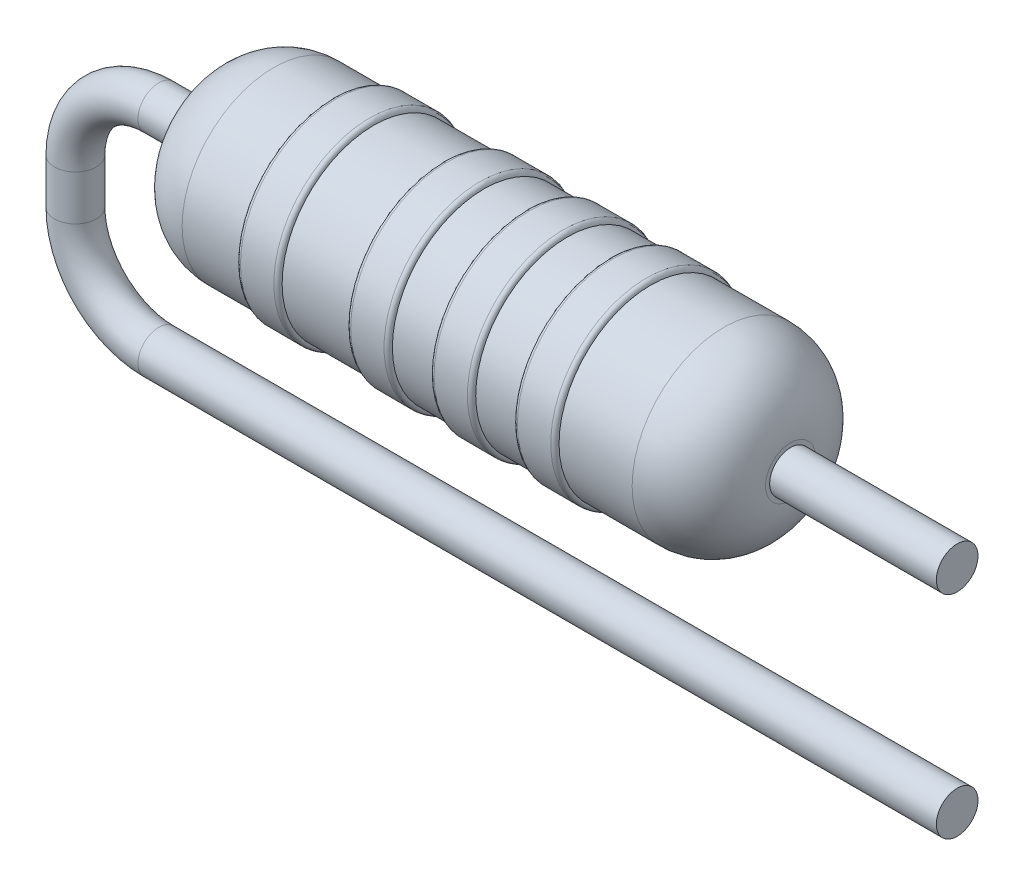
ISO-10303-21;
HEADER;
FILE_DESCRIPTION(('STEP AP214'),'2;1');
FILE_NAME('part.step','',(''),(''),'','','');
FILE_SCHEMA(('AUTOMOTIVE_DESIGN { 1 0 10303 214 1 1 1 1 }'));
ENDSEC;
DATA;
#1=APPLICATION_CONTEXT('core data for automotive mechanical design processes');
#2=APPLICATION_PROTOCOL_DEFINITION('international standard','automotive_design',2000,#1);
#3=PRODUCT_CONTEXT('',#1,'mechanical');
#4=PRODUCT('Part','Part','',(#3));
#5=PRODUCT_RELATED_PRODUCT_CATEGORY('part','',(#4));
#6=PRODUCT_DEFINITION_FORMATION('','',#4);
#7=PRODUCT_DEFINITION_CONTEXT('part definition',#1,'design');
#8=PRODUCT_DEFINITION('design','',#6,#7);
#9=PRODUCT_DEFINITION_SHAPE('','',#8);
#10=(LENGTH_UNIT() NAMED_UNIT(*) SI_UNIT(.MILLI.,.METRE.));
#11=(NAMED_UNIT(*) PLANE_ANGLE_UNIT() SI_UNIT($,.RADIAN.));
#12=(NAMED_UNIT(*) SI_UNIT($,.STERADIAN.) SOLID_ANGLE_UNIT());
#13=UNCERTAINTY_MEASURE_WITH_UNIT(LENGTH_MEASURE(1.E-05),#10,'distance_accuracy_value','');
#14=(GEOMETRIC_REPRESENTATION_CONTEXT(3) GLOBAL_UNCERTAINTY_ASSIGNED_CONTEXT((#13)) GLOBAL_UNIT_ASSIGNED_CONTEXT((#10,
#11,#12)) REPRESENTATION_CONTEXT('',''));
#15=CARTESIAN_POINT('',(0.,0.,0.));
#16=DIRECTION('',(0.,0.,1.));
#17=DIRECTION('',(1.,0.,0.));
#18=AXIS2_PLACEMENT_3D('',#15,#16,#17);
#19=CARTESIAN_POINT('',(3.5,0.299999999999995,0.));
#20=DIRECTION('',(-1.,0.,0.));
#21=DIRECTION('',(0.,0.,1.));
#22=AXIS2_PLACEMENT_3D('',#19,#20,#21);
#23=PLANE('',#22);
#24=CARTESIAN_POINT('',(3.5,0.,0.));
#25=DIRECTION('',(-1.,0.,0.));
#26=DIRECTION('',(0.,0.,1.));
#27=AXIS2_PLACEMENT_3D('',#24,#25,#26);
#28=CIRCLE('',#27,0.299999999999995);
#29=CARTESIAN_POINT('',(3.5,0.,0.299999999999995));
#30=VERTEX_POINT('',#29);
#31=EDGE_CURVE('E72',#30,#30,#28,.T.);
#32=ORIENTED_EDGE('',*,*,#31,.F.);
#33=EDGE_LOOP('',(#32));
#34=FACE_BOUND('',#33,.T.);
#35=CARTESIAN_POINT('',(3.5,0.,0.));
#36=DIRECTION('',(-1.,0.,0.));
#37=DIRECTION('',(0.,0.,1.));
#38=AXIS2_PLACEMENT_3D('',#35,#36,#37);
#39=CIRCLE('',#38,0.25);
#40=CARTESIAN_POINT('',(3.5,0.,0.25));
#41=VERTEX_POINT('',#40);
#42=EDGE_CURVE('E10',#41,#41,#39,.F.);
#43=ORIENTED_EDGE('',*,*,#42,.F.);
#44=EDGE_LOOP('',(#43));
#45=FACE_BOUND('',#44,.T.);
#46=ADVANCED_FACE('F35',(#34,#45),#23,.F.);
#47=CARTESIAN_POINT('',(-3.5,0.,0.));
#48=DIRECTION('',(1.,0.,0.));
#49=DIRECTION('',(0.,0.,-1.));
#50=AXIS2_PLACEMENT_3D('',#47,#48,#49);
#51=PLANE('',#50);
#52=CARTESIAN_POINT('',(-3.5,0.,0.));
#53=DIRECTION('',(-1.,0.,0.));
#54=DIRECTION('',(0.,0.,1.));
#55=AXIS2_PLACEMENT_3D('',#52,#53,#54);
#56=CIRCLE('',#55,0.299999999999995);
#57=CARTESIAN_POINT('',(-3.5,0.,0.299999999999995));
#58=VERTEX_POINT('',#57);
#59=EDGE_CURVE('E96',#58,#58,#56,.T.);
#60=ORIENTED_EDGE('',*,*,#59,.T.);
#61=EDGE_LOOP('',(#60));
#62=FACE_BOUND('',#61,.T.);
#63=CARTESIAN_POINT('',(-3.5,0.,0.));
#64=DIRECTION('',(1.,0.,0.));
#65=DIRECTION('',(0.,0.,-1.));
#66=AXIS2_PLACEMENT_3D('',#63,#64,#65);
#67=CIRCLE('',#66,0.25);
#68=CARTESIAN_POINT('',(-3.5,0.,-0.25));
#69=VERTEX_POINT('',#68);
#70=EDGE_CURVE('E41',#69,#69,#67,.F.);
#71=ORIENTED_EDGE('',*,*,#70,.F.);
#72=EDGE_LOOP('',(#71));
#73=FACE_BOUND('',#72,.T.);
#74=ADVANCED_FACE('F142',(#62,#73),#51,.F.);
#75=CARTESIAN_POINT('',(-54.2686615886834,0.,0.));
#76=DIRECTION('',(-1.,0.,0.));
#77=DIRECTION('',(0.,0.,1.));
#78=AXIS2_PLACEMENT_3D('',#75,#76,#77);
#79=CYLINDRICAL_SURFACE('',#78,1.1);
#80=CARTESIAN_POINT('',(0.322975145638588,0.,0.));
#81=DIRECTION('',(-1.,0.,0.));
#82=DIRECTION('',(0.,0.,1.));
#83=AXIS2_PLACEMENT_3D('',#80,#81,#82);
#84=CIRCLE('',#83,1.1);
#85=CARTESIAN_POINT('',(0.322975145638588,0.,1.1));
#86=VERTEX_POINT('',#85);
#87=EDGE_CURVE('E84',#86,#86,#84,.T.);
#88=ORIENTED_EDGE('',*,*,#87,.T.);
#89=EDGE_LOOP('',(#88));
#90=FACE_BOUND('',#89,.T.);
#91=CARTESIAN_POINT('',(-0.177024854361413,0.,0.));
#92=DIRECTION('',(1.,0.,0.));
#93=DIRECTION('',(0.,0.,-1.));
#94=AXIS2_PLACEMENT_3D('',#91,#92,#93);
#95=CIRCLE('',#94,1.1);
#96=CARTESIAN_POINT('',(-0.177024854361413,0.,-1.1));
#97=VERTEX_POINT('',#96);
#98=EDGE_CURVE('E93',#97,#97,#95,.T.);
#99=ORIENTED_EDGE('',*,*,#98,.T.);
#100=EDGE_LOOP('',(#99));
#101=FACE_BOUND('',#100,.T.);
#102=ADVANCED_FACE('F147',(#90,#101),#79,.T.);
#103=CARTESIAN_POINT('',(4.3261723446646,0.,0.));
#104=DIRECTION('',(1.,0.,0.));
#105=DIRECTION('',(0.,0.,-1.));
#106=AXIS2_PLACEMENT_3D('',#103,#104,#105);
#107=CYLINDRICAL_SURFACE('',#106,1.15);
#108=CARTESIAN_POINT('',(-0.627024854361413,0.,0.));
#109=DIRECTION('',(-1.,0.,0.));
#110=DIRECTION('',(0.,0.,1.));
#111=AXIS2_PLACEMENT_3D('',#108,#109,#110);
#112=CIRCLE('',#111,1.15);
#113=CARTESIAN_POINT('',(-0.627024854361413,0.,1.15));
#114=VERTEX_POINT('',#113);
#115=EDGE_CURVE('E60',#114,#114,#112,.F.);
#116=ORIENTED_EDGE('',*,*,#115,.T.);
#117=EDGE_LOOP('',(#116));
#118=FACE_BOUND('',#117,.T.);
#119=CARTESIAN_POINT('',(-0.227024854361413,0.,0.));
#120=DIRECTION('',(1.,0.,0.));
#121=DIRECTION('',(0.,0.,-1.));
#122=AXIS2_PLACEMENT_3D('',#119,#120,#121);
#123=CIRCLE('',#122,1.15);
#124=CARTESIAN_POINT('',(-0.227024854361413,0.,-1.15));
#125=VERTEX_POINT('',#124);
#126=EDGE_CURVE('E63',#125,#125,#123,.F.);
#127=ORIENTED_EDGE('',*,*,#126,.T.);
#128=EDGE_LOOP('',(#127));
#129=FACE_BOUND('',#128,.T.);
#130=ADVANCED_FACE('F174',(#118,#129),#107,.T.);
#131=CARTESIAN_POINT('',(-1.5,0.,0.));
#132=DIRECTION('',(1.,0.,0.));
#133=DIRECTION('',(0.,0.,-1.));
#134=AXIS2_PLACEMENT_3D('',#131,#132,#133);
#135=CIRCLE('',#134,1.1);
#136=CARTESIAN_POINT('',(-1.5,0.,-1.1));
#137=VERTEX_POINT('',#136);
#138=EDGE_CURVE('E77',#137,#137,#135,.T.);
#139=ORIENTED_EDGE('',*,*,#138,.T.);
#140=EDGE_LOOP('',(#139));
#141=FACE_BOUND('',#140,.T.);
#142=CARTESIAN_POINT('',(-0.677024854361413,0.,0.));
#143=DIRECTION('',(-1.,0.,0.));
#144=DIRECTION('',(0.,0.,1.));
#145=AXIS2_PLACEMENT_3D('',#142,#143,#144);
#146=CIRCLE('',#145,1.1);
#147=CARTESIAN_POINT('',(-0.677024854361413,0.,1.1));
#148=VERTEX_POINT('',#147);
#149=EDGE_CURVE('E90',#148,#148,#146,.T.);
#150=ORIENTED_EDGE('',*,*,#149,.T.);
#151=EDGE_LOOP('',(#150));
#152=FACE_BOUND('',#151,.T.);
#153=ADVANCED_FACE('F170',(#141,#152),#79,.T.);
#154=CARTESIAN_POINT('',(4.3261723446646,0.,0.));
#155=DIRECTION('',(1.,0.,0.));
#156=DIRECTION('',(0.,0.,-1.));
#157=AXIS2_PLACEMENT_3D('',#154,#155,#156);
#158=CYLINDRICAL_SURFACE('',#157,1.15);
#159=CARTESIAN_POINT('',(0.372975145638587,0.,0.));
#160=DIRECTION('',(-1.,0.,0.));
#161=DIRECTION('',(0.,0.,1.));
#162=AXIS2_PLACEMENT_3D('',#159,#160,#161);
#163=CIRCLE('',#162,1.15);
#164=CARTESIAN_POINT('',(0.372975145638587,0.,1.15));
#165=VERTEX_POINT('',#164);
#166=EDGE_CURVE('E54',#165,#165,#163,.F.);
#167=ORIENTED_EDGE('',*,*,#166,.T.);
#168=EDGE_LOOP('',(#167));
#169=FACE_BOUND('',#168,.T.);
#170=CARTESIAN_POINT('',(0.772975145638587,0.,0.));
#171=DIRECTION('',(1.,0.,0.));
#172=DIRECTION('',(0.,0.,-1.));
#173=AXIS2_PLACEMENT_3D('',#170,#171,#172);
#174=CIRCLE('',#173,1.15);
#175=CARTESIAN_POINT('',(0.772975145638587,0.,-1.15));
#176=VERTEX_POINT('',#175);
#177=EDGE_CURVE('E57',#176,#176,#174,.F.);
#178=ORIENTED_EDGE('',*,*,#177,.T.);
#179=EDGE_LOOP('',(#178));
#180=FACE_BOUND('',#179,.T.);
#181=ADVANCED_FACE('F173',(#169,#180),#158,.T.);
#182=CARTESIAN_POINT('',(1.32297514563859,0.,0.));
#183=DIRECTION('',(-1.,0.,0.));
#184=DIRECTION('',(0.,0.,1.));
#185=AXIS2_PLACEMENT_3D('',#182,#183,#184);
#186=CIRCLE('',#185,1.1);
#187=CARTESIAN_POINT('',(1.32297514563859,0.,1.1));
#188=VERTEX_POINT('',#187);
#189=EDGE_CURVE('E76',#188,#188,#186,.T.);
#190=ORIENTED_EDGE('',*,*,#189,.T.);
#191=EDGE_LOOP('',(#190));
#192=FACE_BOUND('',#191,.T.);
#193=CARTESIAN_POINT('',(0.822975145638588,0.,0.));
#194=DIRECTION('',(1.,0.,0.));
#195=DIRECTION('',(0.,0.,-1.));
#196=AXIS2_PLACEMENT_3D('',#193,#194,#195);
#197=CIRCLE('',#196,1.1);
#198=CARTESIAN_POINT('',(0.822975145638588,0.,-1.1));
#199=VERTEX_POINT('',#198);
#200=EDGE_CURVE('E87',#199,#199,#197,.T.);
#201=ORIENTED_EDGE('',*,*,#200,.T.);
#202=EDGE_LOOP('',(#201));
#203=FACE_BOUND('',#202,.T.);
#204=ADVANCED_FACE('F165',(#192,#203),#79,.T.);
#205=CARTESIAN_POINT('',(4.3261723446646,0.,0.));
#206=DIRECTION('',(1.,0.,0.));
#207=DIRECTION('',(0.,0.,-1.));
#208=AXIS2_PLACEMENT_3D('',#205,#206,#207);
#209=CYLINDRICAL_SURFACE('',#208,1.15);
#210=CARTESIAN_POINT('',(1.37297514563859,0.,0.));
#211=DIRECTION('',(-1.,0.,0.));
#212=DIRECTION('',(0.,0.,1.));
#213=AXIS2_PLACEMENT_3D('',#210,#211,#212);
#214=CIRCLE('',#213,1.15);
#215=CARTESIAN_POINT('',(1.37297514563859,0.,1.15));
#216=VERTEX_POINT('',#215);
#217=EDGE_CURVE('E45',#216,#216,#214,.F.);
#218=ORIENTED_EDGE('',*,*,#217,.T.);
#219=EDGE_LOOP('',(#218));
#220=FACE_BOUND('',#219,.T.);
#221=CARTESIAN_POINT('',(1.77297514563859,0.,0.));
#222=DIRECTION('',(1.,0.,0.));
#223=DIRECTION('',(0.,0.,-1.));
#224=AXIS2_PLACEMENT_3D('',#221,#222,#223);
#225=CIRCLE('',#224,1.15);
#226=CARTESIAN_POINT('',(1.77297514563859,0.,-1.15));
#227=VERTEX_POINT('',#226);
#228=EDGE_CURVE('E49',#227,#227,#225,.F.);
#229=ORIENTED_EDGE('',*,*,#228,.T.);
#230=EDGE_LOOP('',(#229));
#231=FACE_BOUND('',#230,.T.);
#232=ADVANCED_FACE('F156',(#220,#231),#209,.T.);
#233=CARTESIAN_POINT('',(2.7,0.,0.));
#234=DIRECTION('',(-1.,0.,0.));
#235=DIRECTION('',(0.,0.,1.));
#236=AXIS2_PLACEMENT_3D('',#233,#234,#235);
#237=DEGENERATE_TOROIDAL_SURFACE('',#236,0.3,0.8,.T.);
#238=CARTESIAN_POINT('',(2.69999999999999,0.,0.));
#239=DIRECTION('',(-1.,0.,0.));
#240=DIRECTION('',(0.,0.,1.));
#241=AXIS2_PLACEMENT_3D('',#238,#239,#240);
#242=CIRCLE('',#241,1.1);
#243=CARTESIAN_POINT('',(2.69999999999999,0.,1.1));
#244=VERTEX_POINT('',#243);
#245=EDGE_CURVE('E101',#244,#244,#242,.T.);
#246=ORIENTED_EDGE('',*,*,#245,.F.);
#247=EDGE_LOOP('',(#246));
#248=FACE_BOUND('',#247,.T.);
#249=ORIENTED_EDGE('',*,*,#31,.T.);
#250=EDGE_LOOP('',(#249));
#251=FACE_BOUND('',#250,.T.);
#252=ADVANCED_FACE('F153',(#248,#251),#237,.T.);
#253=CARTESIAN_POINT('',(1.82297514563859,0.,0.));
#254=DIRECTION('',(1.,0.,0.));
#255=DIRECTION('',(0.,0.,-1.));
#256=AXIS2_PLACEMENT_3D('',#253,#254,#255);
#257=CIRCLE('',#256,1.1);
#258=CARTESIAN_POINT('',(1.82297514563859,0.,-1.1));
#259=VERTEX_POINT('',#258);
#260=EDGE_CURVE('E81',#259,#259,#257,.T.);
#261=ORIENTED_EDGE('',*,*,#260,.T.);
#262=EDGE_LOOP('',(#261));
#263=FACE_BOUND('',#262,.T.);
#264=ORIENTED_EDGE('',*,*,#245,.T.);
#265=EDGE_LOOP('',(#264));
#266=FACE_BOUND('',#265,.T.);
#267=ADVANCED_FACE('F155',(#263,#266),#79,.T.);
#268=CARTESIAN_POINT('',(4.3261723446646,0.,0.));
#269=DIRECTION('',(1.,0.,0.));
#270=DIRECTION('',(0.,0.,-1.));
#271=AXIS2_PLACEMENT_3D('',#268,#269,#270);
#272=CYLINDRICAL_SURFACE('',#271,1.15);
#273=CARTESIAN_POINT('',(-1.95,0.,0.));
#274=DIRECTION('',(-1.,0.,0.));
#275=DIRECTION('',(0.,0.,1.));
#276=AXIS2_PLACEMENT_3D('',#273,#274,#275);
#277=CIRCLE('',#276,1.15);
#278=CARTESIAN_POINT('',(-1.95,0.,1.15));
#279=VERTEX_POINT('',#278);
#280=EDGE_CURVE('E66',#279,#279,#277,.F.);
#281=ORIENTED_EDGE('',*,*,#280,.T.);
#282=EDGE_LOOP('',(#281));
#283=FACE_BOUND('',#282,.T.);
#284=CARTESIAN_POINT('',(-1.55,0.,0.));
#285=DIRECTION('',(1.,0.,0.));
#286=DIRECTION('',(0.,0.,-1.));
#287=AXIS2_PLACEMENT_3D('',#284,#285,#286);
#288=CIRCLE('',#287,1.15);
#289=CARTESIAN_POINT('',(-1.55,0.,-1.15));
#290=VERTEX_POINT('',#289);
#291=EDGE_CURVE('E69',#290,#290,#288,.F.);
#292=ORIENTED_EDGE('',*,*,#291,.T.);
#293=EDGE_LOOP('',(#292));
#294=FACE_BOUND('',#293,.T.);
#295=ADVANCED_FACE('F162',(#283,#294),#272,.T.);
#296=CARTESIAN_POINT('',(-2.7,0.,0.));
#297=DIRECTION('',(-1.,0.,0.));
#298=DIRECTION('',(0.,0.,1.));
#299=AXIS2_PLACEMENT_3D('',#296,#297,#298);
#300=DEGENERATE_TOROIDAL_SURFACE('',#299,0.3,0.8,.T.);
#301=ORIENTED_EDGE('',*,*,#59,.F.);
#302=EDGE_LOOP('',(#301));
#303=FACE_BOUND('',#302,.T.);
#304=CARTESIAN_POINT('',(-2.69999999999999,0.,0.));
#305=DIRECTION('',(-1.,0.,0.));
#306=DIRECTION('',(0.,0.,1.));
#307=AXIS2_PLACEMENT_3D('',#304,#305,#306);
#308=CIRCLE('',#307,1.1);
#309=CARTESIAN_POINT('',(-2.69999999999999,0.,1.1));
#310=VERTEX_POINT('',#309);
#311=EDGE_CURVE('E104',#310,#310,#308,.T.);
#312=ORIENTED_EDGE('',*,*,#311,.T.);
#313=EDGE_LOOP('',(#312));
#314=FACE_BOUND('',#313,.T.);
#315=ADVANCED_FACE('F176',(#303,#314),#300,.T.);
#316=CARTESIAN_POINT('',(-2.,0.,0.));
#317=DIRECTION('',(-1.,0.,0.));
#318=DIRECTION('',(0.,0.,1.));
#319=AXIS2_PLACEMENT_3D('',#316,#317,#318);
#320=CIRCLE('',#319,1.1);
#321=CARTESIAN_POINT('',(-2.,0.,1.1));
#322=VERTEX_POINT('',#321);
#323=EDGE_CURVE('E73',#322,#322,#320,.T.);
#324=ORIENTED_EDGE('',*,*,#323,.T.);
#325=EDGE_LOOP('',(#324));
#326=FACE_BOUND('',#325,.T.);
#327=ORIENTED_EDGE('',*,*,#311,.F.);
#328=EDGE_LOOP('',(#327));
#329=FACE_BOUND('',#328,.T.);
#330=ADVANCED_FACE('F166',(#326,#329),#79,.T.);
#331=CARTESIAN_POINT('',(-1.95,0.,0.));
#332=DIRECTION('',(-1.,0.,0.));
#333=DIRECTION('',(0.,0.,1.));
#334=AXIS2_PLACEMENT_3D('',#331,#332,#333);
#335=TOROIDAL_SURFACE('',#334,1.1,0.05);
#336=ORIENTED_EDGE('',*,*,#323,.F.);
#337=EDGE_LOOP('',(#336));
#338=FACE_BOUND('',#337,.T.);
#339=ORIENTED_EDGE('',*,*,#280,.F.);
#340=EDGE_LOOP('',(#339));
#341=FACE_BOUND('',#340,.T.);
#342=ADVANCED_FACE('F189',(#338,#341),#335,.T.);
#343=CARTESIAN_POINT('',(-1.55,0.,0.));
#344=DIRECTION('',(1.,0.,0.));
#345=DIRECTION('',(0.,0.,-1.));
#346=AXIS2_PLACEMENT_3D('',#343,#344,#345);
#347=TOROIDAL_SURFACE('',#346,1.1,0.05);
#348=ORIENTED_EDGE('',*,*,#291,.F.);
#349=EDGE_LOOP('',(#348));
#350=FACE_BOUND('',#349,.T.);
#351=ORIENTED_EDGE('',*,*,#138,.F.);
#352=EDGE_LOOP('',(#351));
#353=FACE_BOUND('',#352,.T.);
#354=ADVANCED_FACE('F192',(#350,#353),#347,.T.);
#355=CARTESIAN_POINT('',(-0.627024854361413,0.,0.));
#356=DIRECTION('',(-1.,0.,0.));
#357=DIRECTION('',(0.,0.,1.));
#358=AXIS2_PLACEMENT_3D('',#355,#356,#357);
#359=TOROIDAL_SURFACE('',#358,1.1,0.05);
#360=ORIENTED_EDGE('',*,*,#149,.F.);
#361=EDGE_LOOP('',(#360));
#362=FACE_BOUND('',#361,.T.);
#363=ORIENTED_EDGE('',*,*,#115,.F.);
#364=EDGE_LOOP('',(#363));
#365=FACE_BOUND('',#364,.T.);
#366=ADVANCED_FACE('F196',(#362,#365),#359,.T.);
#367=CARTESIAN_POINT('',(-0.227024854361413,0.,0.));
#368=DIRECTION('',(1.,0.,0.));
#369=DIRECTION('',(0.,0.,-1.));
#370=AXIS2_PLACEMENT_3D('',#367,#368,#369);
#371=TOROIDAL_SURFACE('',#370,1.1,0.05);
#372=ORIENTED_EDGE('',*,*,#126,.F.);
#373=EDGE_LOOP('',(#372));
#374=FACE_BOUND('',#373,.T.);
#375=ORIENTED_EDGE('',*,*,#98,.F.);
#376=EDGE_LOOP('',(#375));
#377=FACE_BOUND('',#376,.T.);
#378=ADVANCED_FACE('F200',(#374,#377),#371,.T.);
#379=CARTESIAN_POINT('',(0.372975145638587,0.,0.));
#380=DIRECTION('',(-1.,0.,0.));
#381=DIRECTION('',(0.,0.,1.));
#382=AXIS2_PLACEMENT_3D('',#379,#380,#381);
#383=TOROIDAL_SURFACE('',#382,1.1,0.05);
#384=ORIENTED_EDGE('',*,*,#87,.F.);
#385=EDGE_LOOP('',(#384));
#386=FACE_BOUND('',#385,.T.);
#387=ORIENTED_EDGE('',*,*,#166,.F.);
#388=EDGE_LOOP('',(#387));
#389=FACE_BOUND('',#388,.T.);
#390=ADVANCED_FACE('F204',(#386,#389),#383,.T.);
#391=CARTESIAN_POINT('',(0.772975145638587,0.,0.));
#392=DIRECTION('',(1.,0.,0.));
#393=DIRECTION('',(0.,0.,-1.));
#394=AXIS2_PLACEMENT_3D('',#391,#392,#393);
#395=TOROIDAL_SURFACE('',#394,1.1,0.05);
#396=ORIENTED_EDGE('',*,*,#177,.F.);
#397=EDGE_LOOP('',(#396));
#398=FACE_BOUND('',#397,.T.);
#399=ORIENTED_EDGE('',*,*,#200,.F.);
#400=EDGE_LOOP('',(#399));
#401=FACE_BOUND('',#400,.T.);
#402=ADVANCED_FACE('F208',(#398,#401),#395,.T.);
#403=CARTESIAN_POINT('',(1.37297514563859,0.,0.));
#404=DIRECTION('',(-1.,0.,0.));
#405=DIRECTION('',(0.,0.,1.));
#406=AXIS2_PLACEMENT_3D('',#403,#404,#405);
#407=TOROIDAL_SURFACE('',#406,1.1,0.05);
#408=ORIENTED_EDGE('',*,*,#189,.F.);
#409=EDGE_LOOP('',(#408));
#410=FACE_BOUND('',#409,.T.);
#411=ORIENTED_EDGE('',*,*,#217,.F.);
#412=EDGE_LOOP('',(#411));
#413=FACE_BOUND('',#412,.T.);
#414=ADVANCED_FACE('F212',(#410,#413),#407,.T.);
#415=CARTESIAN_POINT('',(1.77297514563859,0.,0.));
#416=DIRECTION('',(1.,0.,0.));
#417=DIRECTION('',(0.,0.,-1.));
#418=AXIS2_PLACEMENT_3D('',#415,#416,#417);
#419=TOROIDAL_SURFACE('',#418,1.1,0.05);
#420=ORIENTED_EDGE('',*,*,#228,.F.);
#421=EDGE_LOOP('',(#420));
#422=FACE_BOUND('',#421,.T.);
#423=ORIENTED_EDGE('',*,*,#260,.F.);
#424=EDGE_LOOP('',(#423));
#425=FACE_BOUND('',#424,.T.);
#426=ADVANCED_FACE('F216',(#422,#425),#419,.T.);
#427=CARTESIAN_POINT('',(-4.07999999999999,-2.54,0.));
#428=DIRECTION('',(1.,0.,0.));
#429=DIRECTION('',(0.,1.,0.));
#430=AXIS2_PLACEMENT_3D('',#427,#428,#429);
#431=CYLINDRICAL_SURFACE('',#430,0.25);
#432=CARTESIAN_POINT('',(-4.07999999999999,-2.54,0.));
#433=DIRECTION('',(1.,0.,0.));
#434=DIRECTION('',(0.,0.,1.));
#435=AXIS2_PLACEMENT_3D('',#432,#433,#434);
#436=CIRCLE('',#435,0.25);
#437=CARTESIAN_POINT('',(-4.07999999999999,-2.79,0.));
#438=VERTEX_POINT('',#437);
#439=EDGE_CURVE('E111',#438,#438,#436,.T.);
#440=ORIENTED_EDGE('',*,*,#439,.T.);
#441=EDGE_LOOP('',(#440));
#442=FACE_BOUND('',#441,.T.);
#443=CARTESIAN_POINT('',(5.5,-2.54,0.));
#444=DIRECTION('',(1.,0.,0.));
#445=DIRECTION('',(0.,0.,1.));
#446=AXIS2_PLACEMENT_3D('',#443,#444,#445);
#447=CIRCLE('',#446,0.25);
#448=CARTESIAN_POINT('',(5.5,-2.54,0.25));
#449=VERTEX_POINT('',#448);
#450=EDGE_CURVE('E80',#449,#449,#447,.T.);
#451=ORIENTED_EDGE('',*,*,#450,.F.);
#452=EDGE_LOOP('',(#451));
#453=FACE_BOUND('',#452,.T.);
#454=ADVANCED_FACE('F220',(#442,#453),#431,.T.);
#455=CARTESIAN_POINT('',(-4.08,-1.54,0.));
#456=DIRECTION('',(0.,0.,1.));
#457=DIRECTION('',(1.,0.,0.));
#458=AXIS2_PLACEMENT_3D('',#455,#456,#457);
#459=TOROIDAL_SURFACE('',#458,1.,0.25);
#460=CARTESIAN_POINT('',(-5.08,-1.53999999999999,0.));
#461=DIRECTION('',(0.,-1.,0.));
#462=DIRECTION('',(0.,0.,1.));
#463=AXIS2_PLACEMENT_3D('',#460,#461,#462);
#464=CIRCLE('',#463,0.25);
#465=CARTESIAN_POINT('',(-5.33,-1.53999999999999,0.));
#466=VERTEX_POINT('',#465);
#467=EDGE_CURVE('E114',#466,#466,#464,.T.);
#468=CARTESIAN_POINT('',(-4.08,-1.54,0.));
#469=DIRECTION('',(0.,0.,1.));
#470=DIRECTION('',(1.,0.,0.));
#471=AXIS2_PLACEMENT_3D('',#468,#469,#470);
#472=CIRCLE('',#471,1.25);
#473=EDGE_CURVE('',#466,#438,#472,.T.);
#474=ORIENTED_EDGE('',*,*,#467,.T.);
#475=ORIENTED_EDGE('',*,*,#439,.F.);
#476=ORIENTED_EDGE('',*,*,#473,.T.);
#477=ORIENTED_EDGE('',*,*,#473,.F.);
#478=EDGE_LOOP('',(#474,#476,#475,#477));
#479=FACE_BOUND('',#478,.T.);
#480=ADVANCED_FACE('F224',(#479),#459,.T.);
#481=CARTESIAN_POINT('',(-5.08,-1.00000000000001,0.));
#482=DIRECTION('',(0.,-1.,0.));
#483=DIRECTION('',(0.,0.,-1.));
#484=AXIS2_PLACEMENT_3D('',#481,#482,#483);
#485=CYLINDRICAL_SURFACE('',#484,0.25);
#486=CARTESIAN_POINT('',(-5.08,-1.00000000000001,0.));
#487=DIRECTION('',(0.,-1.,0.));
#488=DIRECTION('',(0.,0.,1.));
#489=AXIS2_PLACEMENT_3D('',#486,#487,#488);
#490=CIRCLE('',#489,0.25);
#491=CARTESIAN_POINT('',(-5.33,-1.00000000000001,0.));
#492=VERTEX_POINT('',#491);
#493=EDGE_CURVE('E117',#492,#492,#490,.T.);
#494=ORIENTED_EDGE('',*,*,#493,.T.);
#495=EDGE_LOOP('',(#494));
#496=FACE_BOUND('',#495,.T.);
#497=ORIENTED_EDGE('',*,*,#467,.F.);
#498=EDGE_LOOP('',(#497));
#499=FACE_BOUND('',#498,.T.);
#500=ADVANCED_FACE('F228',(#496,#499),#485,.T.);
#501=CARTESIAN_POINT('',(-4.08,-1.,0.));
#502=DIRECTION('',(0.,0.,1.));
#503=DIRECTION('',(1.,0.,0.));
#504=AXIS2_PLACEMENT_3D('',#501,#502,#503);
#505=TOROIDAL_SURFACE('',#504,1.,0.25);
#506=CARTESIAN_POINT('',(-4.07999999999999,0.,0.));
#507=DIRECTION('',(-1.,0.,0.));
#508=DIRECTION('',(0.,0.,1.));
#509=AXIS2_PLACEMENT_3D('',#506,#507,#508);
#510=CIRCLE('',#509,0.25);
#511=CARTESIAN_POINT('',(-4.07999999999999,0.25,0.));
#512=VERTEX_POINT('',#511);
#513=EDGE_CURVE('E120',#512,#512,#510,.T.);
#514=CARTESIAN_POINT('',(-4.08,-1.,0.));
#515=DIRECTION('',(0.,0.,1.));
#516=DIRECTION('',(1.,0.,0.));
#517=AXIS2_PLACEMENT_3D('',#514,#515,#516);
#518=CIRCLE('',#517,1.25);
#519=EDGE_CURVE('',#512,#492,#518,.T.);
#520=ORIENTED_EDGE('',*,*,#513,.T.);
#521=ORIENTED_EDGE('',*,*,#493,.F.);
#522=ORIENTED_EDGE('',*,*,#519,.T.);
#523=ORIENTED_EDGE('',*,*,#519,.F.);
#524=EDGE_LOOP('',(#520,#522,#521,#523));
#525=FACE_BOUND('',#524,.T.);
#526=ADVANCED_FACE('F232',(#525),#505,.T.);
#527=CARTESIAN_POINT('',(-4.07999999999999,0.,0.));
#528=DIRECTION('',(1.,0.,0.));
#529=DIRECTION('',(0.,0.,-1.));
#530=AXIS2_PLACEMENT_3D('',#527,#528,#529);
#531=CYLINDRICAL_SURFACE('',#530,0.25);
#532=ORIENTED_EDGE('',*,*,#513,.F.);
#533=EDGE_LOOP('',(#532));
#534=FACE_BOUND('',#533,.T.);
#535=ORIENTED_EDGE('',*,*,#70,.T.);
#536=EDGE_LOOP('',(#535));
#537=FACE_BOUND('',#536,.T.);
#538=ADVANCED_FACE('F138',(#534,#537),#531,.T.);
#539=CARTESIAN_POINT('',(5.5,-2.54,0.));
#540=DIRECTION('',(1.,0.,0.));
#541=DIRECTION('',(0.,0.,1.));
#542=AXIS2_PLACEMENT_3D('',#539,#540,#541);
#543=PLANE('',#542);
#544=ORIENTED_EDGE('',*,*,#450,.T.);
#545=EDGE_LOOP('',(#544));
#546=FACE_BOUND('',#545,.T.);
#547=ADVANCED_FACE('F131',(#546),#543,.T.);
#548=CARTESIAN_POINT('',(5.5,0.,0.));
#549=DIRECTION('',(-1.,0.,0.));
#550=DIRECTION('',(0.,0.,1.));
#551=AXIS2_PLACEMENT_3D('',#548,#549,#550);
#552=CYLINDRICAL_SURFACE('',#551,0.25);
#553=CARTESIAN_POINT('',(5.5,0.,0.));
#554=DIRECTION('',(1.,0.,0.));
#555=DIRECTION('',(0.,0.,-1.));
#556=AXIS2_PLACEMENT_3D('',#553,#554,#555);
#557=CIRCLE('',#556,0.25);
#558=CARTESIAN_POINT('',(5.5,0.,-0.25));
#559=VERTEX_POINT('',#558);
#560=EDGE_CURVE('E123',#559,#559,#557,.T.);
#561=ORIENTED_EDGE('',*,*,#560,.F.);
#562=EDGE_LOOP('',(#561));
#563=FACE_BOUND('',#562,.T.);
#564=ORIENTED_EDGE('',*,*,#42,.T.);
#565=EDGE_LOOP('',(#564));
#566=FACE_BOUND('',#565,.T.);
#567=ADVANCED_FACE('F129',(#563,#566),#552,.T.);
#568=CARTESIAN_POINT('',(5.5,0.,0.));
#569=DIRECTION('',(1.,0.,0.));
#570=DIRECTION('',(0.,0.,-1.));
#571=AXIS2_PLACEMENT_3D('',#568,#569,#570);
#572=PLANE('',#571);
#573=ORIENTED_EDGE('',*,*,#560,.T.);
#574=EDGE_LOOP('',(#573));
#575=FACE_BOUND('',#574,.T.);
#576=ADVANCED_FACE('F127',(#575),#572,.T.);
#577=CLOSED_SHELL('',(#46,#74,#102,#130,#153,#181,#204,#232,#252,#267,#295,#315,#330,#342,#354,
#366,#378,#390,#402,#414,#426,#454,#480,#500,#526,#538,#547,#567,#576));
#578=MANIFOLD_SOLID_BREP('B2',#577);
#579=ADVANCED_BREP_SHAPE_REPRESENTATION('',(#18,#578),#14);
#580=SHAPE_DEFINITION_REPRESENTATION(#9,#579);
ENDSEC;
END-ISO-10303-21;
